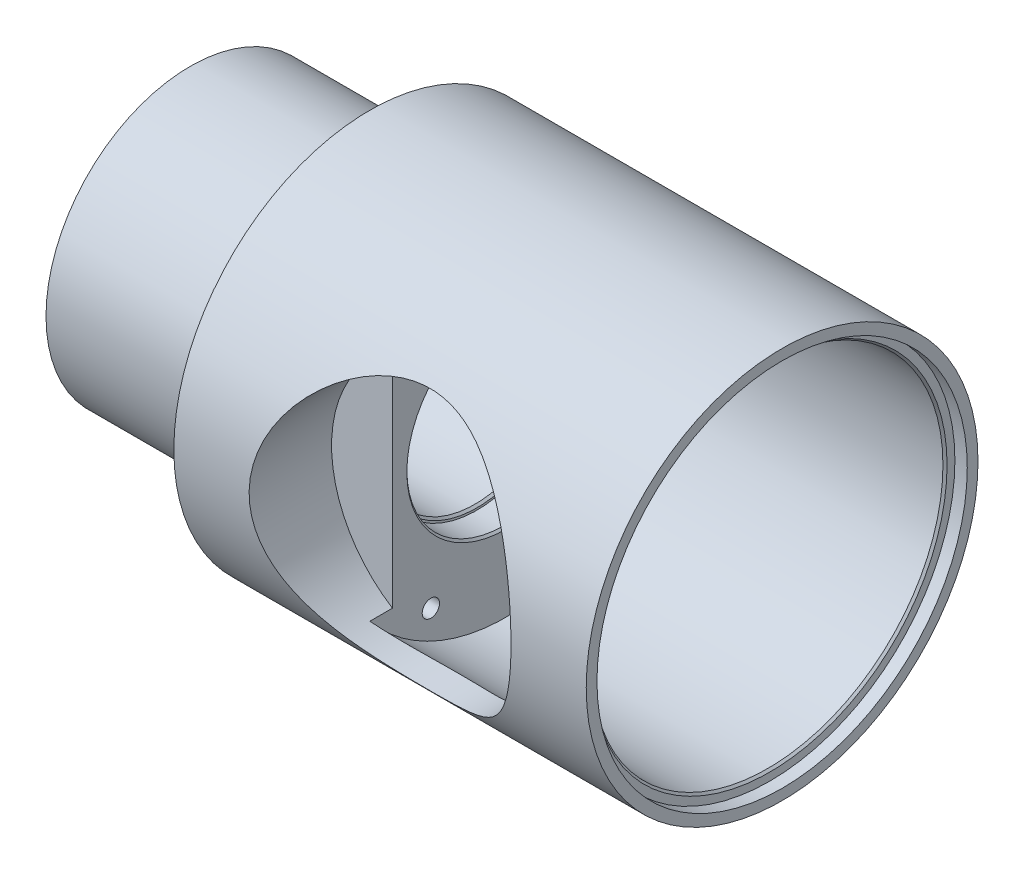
from build123d import *

# Parameters (mm, degrees)
SKETCH1_R                 = 47.5
SKETCH1_R_2               = 42.5
BOSS_EXTRUDE1_DEPTH       = 100
BOSS_EXTRUDE2_DEPTH       = 46
BOSS_EXTRUDE2_DEPTH_BACK  = 33
SKETCH3_R                 = 42.5
SKETCH4_R                 = 31.75
CUT_EXTRUDE1_DEPTH        = 20
SKETCH5_R                 = 23.5
CUT_EXTRUDE2_DEPTH        = 7
SKETCH6_R                 = 22.5
CUT_EXTRUDE3_DEPTH        = 35
CIRPATTERN1_COUNT         = 3
SKETCH9_R                 = 21
CUT_EXTRUDE4_DEPTH        = 12
CHAMFER1_SIZE             = 0.5
SKETCH10_OUTSIDE_W        = 136.682
SKETCH10_OUTSIDE_H        = 136.682
SKETCH10_OUTSIDE_R        = 35
CUT_EXTRUDE5_DEPTH        = 121.467838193
M5X0_8_TAPPED_HOLE2_D     = 4.2
M5X0_8_TAPPED_HOLE2_DEPTH = 14
M5X0_8_TAPPED_HOLE2_TIP   = 1.2618073
CUT_EXTRUDE11_START       = -23
SKETCH20_R                = 21
CUT_EXTRUDE11_DEPTH       = 23
CUT_EXTRUDE12_REACH       = 142.148
SKETCH21_R                = 14
CUT_EXTRUDE13_START       = -2.5
SKETCH22_R                = 35
CUT_EXTRUDE13_DEPTH       = 2.5
SKETCH23_R                = 44.9
CUT_EXTRUDE14_DEPTH       = 3
CHAMFER2_SIZE             = 0.5


with BuildPart() as part:
    # Sketch1 → Boss-Extrude1 (new body)
    with BuildSketch(Plane(origin=(0, 0, 0), x_dir=(0, 0, -1), z_dir=(1, 0, 0))):
        Circle(SKETCH1_R)
        Circle(SKETCH1_R_2, mode=Mode.SUBTRACT)
    extrude(amount=BOSS_EXTRUDE1_DEPTH)

    # Sketch3 → Boss-Extrude2 (add, two sides: drawn at the far end of the back side and taken through both)
    with BuildSketch(Plane.ZY.offset(-BOSS_EXTRUDE2_DEPTH_BACK)):
        Circle(SKETCH3_R)
    extrude(amount=BOSS_EXTRUDE2_DEPTH + BOSS_EXTRUDE2_DEPTH_BACK)

    # Sketch4 → Cut-Extrude1 (cut)
    with BuildSketch(Plane.XY.offset(47.5)):
        with Locations((50, 0)):
            Circle(SKETCH4_R)
    extrude(amount=-CUT_EXTRUDE1_DEPTH, mode=Mode.SUBTRACT)

    # Sketch5 → Cut-Extrude2 (cut)
    with BuildSketch(Plane(origin=(33, 0, 0), x_dir=(0, 0, -1), z_dir=(1, 0, 0))):
        Circle(SKETCH5_R)
    extrude(amount=-CUT_EXTRUDE2_DEPTH, mode=Mode.SUBTRACT)

    # Sketch6 → Cut-Extrude3 (cut)
    with BuildSketch(Plane(origin=(26, 0, 0), x_dir=(0, 0, -1), z_dir=(1, 0, 0))):
        Circle(SKETCH6_R)
    extrude(amount=-CUT_EXTRUDE3_DEPTH, mode=Mode.SUBTRACT)

    # Sketch7 → M5x0.8 Tapped Hole1 (revolve, cut)
    with BuildSketch(Plane(origin=(33, 0, -36.35), x_dir=(0, 0, -1), z_dir=(0, 1, 0))):
        Polygon((0, 0), (0, 15.2618073), (2.1, 14), (2.1, 0), align=None)
    m5x0_8_tapped_hole1 = revolve(axis=Axis((39.35, 0, -36.35), (-1, 0, 0)), mode=Mode.SUBTRACT)

    # CirPattern1: M5x0.8 Tapped Hole1 ×3 about axis
    cirpattern1_axis = Axis((0, 0, 0), (1, 0, 0))
    for i in range(1, CIRPATTERN1_COUNT):
        add(m5x0_8_tapped_hole1.rotate(cirpattern1_axis, i * 360 / CIRPATTERN1_COUNT), mode=Mode.SUBTRACT)

    # Sketch9 → Cut-Extrude4 (cut)
    with BuildSketch(Plane(origin=(-9, 0, 0), x_dir=(0, 0, -1), z_dir=(1, 0, 0))):
        Circle(SKETCH9_R)
    extrude(amount=-CUT_EXTRUDE4_DEPTH, mode=Mode.SUBTRACT)

    # Chamfer1
    chamfer1_edges = [part.edges().sort_by_distance(p)[0] for p in [
        (33, 0, 23.5),
        (26, 0, 22.5),
    ]]
    chamfer(chamfer1_edges, length=CHAMFER1_SIZE)

    # Sketch10 outside → Cut-Extrude5 (cut, through all)
    with BuildSketch(Plane.ZY):
        Rectangle(SKETCH10_OUTSIDE_W, SKETCH10_OUTSIDE_H)
        Circle(SKETCH10_OUTSIDE_R, mode=Mode.SUBTRACT)
    extrude(amount=CUT_EXTRUDE5_DEPTH, mode=Mode.SUBTRACT)

    # M5x0.8 Tapped Hole2
    with Locations(Plane.ZY.offset(46)):
        with Locations((-28, 0), (28, 0)):
            Hole(M5X0_8_TAPPED_HOLE2_D / 2, depth=M5X0_8_TAPPED_HOLE2_DEPTH)
            with Locations((0, 0, -(M5X0_8_TAPPED_HOLE2_DEPTH + M5X0_8_TAPPED_HOLE2_TIP / 2))):  # 118° drill point
                Cone(0, M5X0_8_TAPPED_HOLE2_D / 2, M5X0_8_TAPPED_HOLE2_TIP, mode=Mode.SUBTRACT)

    # Sketch20 → Cut-Extrude11 (cut)
    with BuildSketch(Plane.ZY.offset(46).offset(CUT_EXTRUDE11_START)):
        with Locations(Location((0, 0, 0), (0, 0, 180))):
            Circle(SKETCH20_R)
    extrude(amount=CUT_EXTRUDE11_DEPTH, mode=Mode.SUBTRACT)

    # Sketch21 → Cut-Extrude12 (cut, up to next)
    with BuildSketch(Plane.ZY.offset(23), mode=Mode.PRIVATE) as cut_extrude12_sk1:
        Circle(SKETCH21_R)
    cut_extrude12_tool1 = extrude(cut_extrude12_sk1.sketch, amount=-CUT_EXTRUDE12_REACH, mode=Mode.PRIVATE) & part.part
    add(cut_extrude12_tool1.solids().sort_by_distance((-23, 0, 0))[0], mode=Mode.SUBTRACT)

    # Sketch22 → Cut-Extrude13 (cut)
    with BuildSketch(Plane.ZY.offset(46).offset(CUT_EXTRUDE13_START)):
        Circle(SKETCH22_R)
    extrude(amount=CUT_EXTRUDE13_DEPTH, mode=Mode.SUBTRACT)

    # Sketch23 → Cut-Extrude14 (cut)
    with BuildSketch(Plane(origin=(100, 0, 0), x_dir=(0, 0, -1), z_dir=(1, 0, 0))):
        Circle(SKETCH23_R)
    extrude(amount=-CUT_EXTRUDE14_DEPTH, mode=Mode.SUBTRACT)

    # Chamfer2
    chamfer2_edges = [part.edges().sort_by_distance(p)[0] for p in [
        (97, 0, 42.5),
    ]]
    chamfer(chamfer2_edges, length=CHAMFER2_SIZE)


solid = part.part
